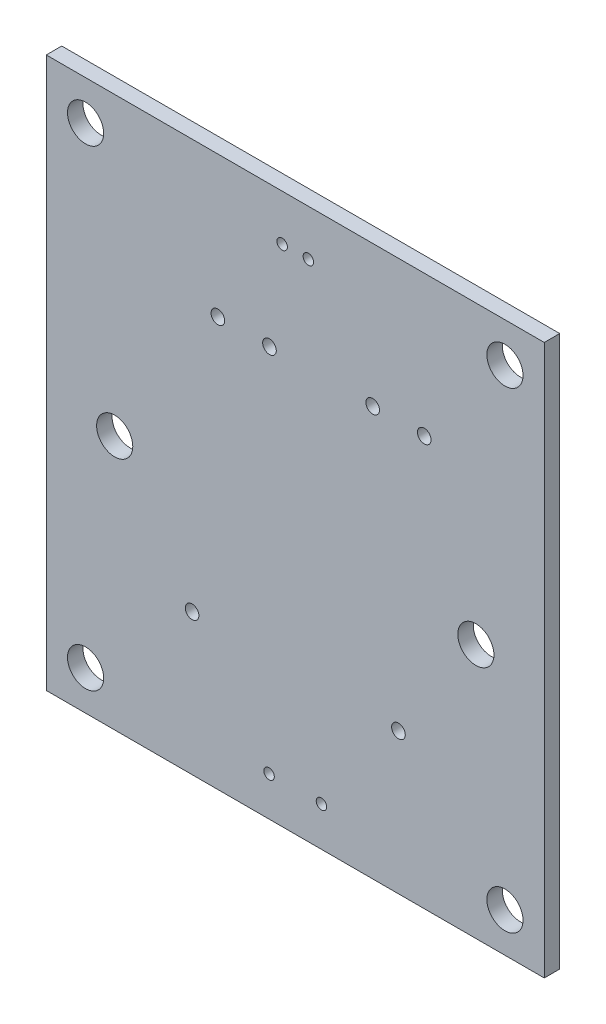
ISO-10303-21;
HEADER;
FILE_DESCRIPTION(('STEP AP214'),'2;1');
FILE_NAME('part.step','',(''),(''),'','','');
FILE_SCHEMA(('AUTOMOTIVE_DESIGN { 1 0 10303 214 1 1 1 1 }'));
ENDSEC;
DATA;
#1=APPLICATION_CONTEXT('core data for automotive mechanical design processes');
#2=APPLICATION_PROTOCOL_DEFINITION('international standard','automotive_design',2000,#1);
#3=PRODUCT_CONTEXT('',#1,'mechanical');
#4=PRODUCT('Part','Part','',(#3));
#5=PRODUCT_RELATED_PRODUCT_CATEGORY('part','',(#4));
#6=PRODUCT_DEFINITION_FORMATION('','',#4);
#7=PRODUCT_DEFINITION_CONTEXT('part definition',#1,'design');
#8=PRODUCT_DEFINITION('design','',#6,#7);
#9=PRODUCT_DEFINITION_SHAPE('','',#8);
#10=(LENGTH_UNIT() NAMED_UNIT(*) SI_UNIT(.MILLI.,.METRE.));
#11=(NAMED_UNIT(*) PLANE_ANGLE_UNIT() SI_UNIT($,.RADIAN.));
#12=(NAMED_UNIT(*) SI_UNIT($,.STERADIAN.) SOLID_ANGLE_UNIT());
#13=UNCERTAINTY_MEASURE_WITH_UNIT(LENGTH_MEASURE(1.E-05),#10,'distance_accuracy_value','');
#14=(GEOMETRIC_REPRESENTATION_CONTEXT(3) GLOBAL_UNCERTAINTY_ASSIGNED_CONTEXT((#13)) GLOBAL_UNIT_ASSIGNED_CONTEXT((#10,
#11,#12)) REPRESENTATION_CONTEXT('',''));
#15=CARTESIAN_POINT('',(0.,0.,0.));
#16=DIRECTION('',(0.,0.,1.));
#17=DIRECTION('',(1.,0.,0.));
#18=AXIS2_PLACEMENT_3D('',#15,#16,#17);
#19=CARTESIAN_POINT('',(0.,0.,1.4986));
#20=DIRECTION('',(1.,0.,0.));
#21=DIRECTION('',(0.,0.,-1.));
#22=AXIS2_PLACEMENT_3D('',#19,#20,#21);
#23=PLANE('',#22);
#24=DIRECTION('',(0.,-1.,0.));
#25=VECTOR('',#24,1.);
#26=CARTESIAN_POINT('',(0.,0.,0.));
#27=LINE('',#26,#25);
#28=CARTESIAN_POINT('',(0.,0.,0.));
#29=VERTEX_POINT('',#28);
#30=CARTESIAN_POINT('',(0.,-53.34,0.));
#31=VERTEX_POINT('',#30);
#32=EDGE_CURVE('E94',#29,#31,#27,.T.);
#33=ORIENTED_EDGE('',*,*,#32,.T.);
#34=DIRECTION('',(0.,0.,-1.));
#35=VECTOR('',#34,1.);
#36=CARTESIAN_POINT('',(0.,-53.34,1.4986));
#37=LINE('',#36,#35);
#38=CARTESIAN_POINT('',(0.,-53.34,1.4986));
#39=VERTEX_POINT('',#38);
#40=EDGE_CURVE('E11',#39,#31,#37,.T.);
#41=ORIENTED_EDGE('',*,*,#40,.F.);
#42=DIRECTION('',(0.,-1.,0.));
#43=VECTOR('',#42,1.);
#44=CARTESIAN_POINT('',(0.,0.,1.4986));
#45=LINE('',#44,#43);
#46=CARTESIAN_POINT('',(0.,0.,1.4986));
#47=VERTEX_POINT('',#46);
#48=EDGE_CURVE('E82',#47,#39,#45,.T.);
#49=ORIENTED_EDGE('',*,*,#48,.F.);
#50=DIRECTION('',(0.,0.,-1.));
#51=VECTOR('',#50,1.);
#52=CARTESIAN_POINT('',(0.,0.,1.4986));
#53=LINE('',#52,#51);
#54=EDGE_CURVE('E90',#47,#29,#53,.T.);
#55=ORIENTED_EDGE('',*,*,#54,.T.);
#56=EDGE_LOOP('',(#33,#41,#49,#55));
#57=FACE_BOUND('',#56,.T.);
#58=ADVANCED_FACE('F31',(#57),#23,.F.);
#59=CARTESIAN_POINT('',(0.,-53.34,1.4986));
#60=DIRECTION('',(0.,1.,0.));
#61=DIRECTION('',(0.,0.,1.));
#62=AXIS2_PLACEMENT_3D('',#59,#60,#61);
#63=PLANE('',#62);
#64=DIRECTION('',(1.,0.,0.));
#65=VECTOR('',#64,1.);
#66=CARTESIAN_POINT('',(0.,-53.34,0.));
#67=LINE('',#66,#65);
#68=CARTESIAN_POINT('',(48.26,-53.34,0.));
#69=VERTEX_POINT('',#68);
#70=EDGE_CURVE('E86',#31,#69,#67,.T.);
#71=ORIENTED_EDGE('',*,*,#70,.T.);
#72=DIRECTION('',(0.,0.,-1.));
#73=VECTOR('',#72,1.);
#74=CARTESIAN_POINT('',(48.26,-53.34,1.4986));
#75=LINE('',#74,#73);
#76=CARTESIAN_POINT('',(48.26,-53.34,1.4986));
#77=VERTEX_POINT('',#76);
#78=EDGE_CURVE('E39',#77,#69,#75,.T.);
#79=ORIENTED_EDGE('',*,*,#78,.F.);
#80=DIRECTION('',(1.,0.,0.));
#81=VECTOR('',#80,1.);
#82=CARTESIAN_POINT('',(0.,-53.34,1.4986));
#83=LINE('',#82,#81);
#84=EDGE_CURVE('E77',#39,#77,#83,.T.);
#85=ORIENTED_EDGE('',*,*,#84,.F.);
#86=ORIENTED_EDGE('',*,*,#40,.T.);
#87=EDGE_LOOP('',(#71,#79,#85,#86));
#88=FACE_BOUND('',#87,.T.);
#89=ADVANCED_FACE('F85',(#88),#63,.F.);
#90=CARTESIAN_POINT('',(48.26,0.,1.4986));
#91=DIRECTION('',(-1.,0.,0.));
#92=DIRECTION('',(0.,-1.,0.));
#93=AXIS2_PLACEMENT_3D('',#90,#91,#92);
#94=PLANE('',#93);
#95=DIRECTION('',(0.,1.,0.));
#96=VECTOR('',#95,1.);
#97=CARTESIAN_POINT('',(48.26,0.,0.));
#98=LINE('',#97,#96);
#99=CARTESIAN_POINT('',(48.26,0.,0.));
#100=VERTEX_POINT('',#99);
#101=EDGE_CURVE('E64',#69,#100,#98,.T.);
#102=ORIENTED_EDGE('',*,*,#101,.T.);
#103=DIRECTION('',(0.,0.,-1.));
#104=VECTOR('',#103,1.);
#105=CARTESIAN_POINT('',(48.26,0.,1.4986));
#106=LINE('',#105,#104);
#107=CARTESIAN_POINT('',(48.26,0.,1.4986));
#108=VERTEX_POINT('',#107);
#109=EDGE_CURVE('E87',#108,#100,#106,.T.);
#110=ORIENTED_EDGE('',*,*,#109,.F.);
#111=DIRECTION('',(0.,1.,0.));
#112=VECTOR('',#111,1.);
#113=CARTESIAN_POINT('',(48.26,0.,1.4986));
#114=LINE('',#113,#112);
#115=EDGE_CURVE('E80',#77,#108,#114,.T.);
#116=ORIENTED_EDGE('',*,*,#115,.F.);
#117=ORIENTED_EDGE('',*,*,#78,.T.);
#118=EDGE_LOOP('',(#102,#110,#116,#117));
#119=FACE_BOUND('',#118,.T.);
#120=ADVANCED_FACE('F88',(#119),#94,.F.);
#121=CARTESIAN_POINT('',(0.,0.,1.4986));
#122=DIRECTION('',(0.,-1.,0.));
#123=DIRECTION('',(0.,0.,-1.));
#124=AXIS2_PLACEMENT_3D('',#121,#122,#123);
#125=PLANE('',#124);
#126=DIRECTION('',(-1.,0.,0.));
#127=VECTOR('',#126,1.);
#128=CARTESIAN_POINT('',(0.,0.,0.));
#129=LINE('',#128,#127);
#130=EDGE_CURVE('E70',#100,#29,#129,.T.);
#131=ORIENTED_EDGE('',*,*,#130,.T.);
#132=ORIENTED_EDGE('',*,*,#54,.F.);
#133=DIRECTION('',(-1.,0.,0.));
#134=VECTOR('',#133,1.);
#135=CARTESIAN_POINT('',(0.,0.,1.4986));
#136=LINE('',#135,#134);
#137=EDGE_CURVE('E47',#108,#47,#136,.T.);
#138=ORIENTED_EDGE('',*,*,#137,.F.);
#139=ORIENTED_EDGE('',*,*,#109,.T.);
#140=EDGE_LOOP('',(#131,#132,#138,#139));
#141=FACE_BOUND('',#140,.T.);
#142=ADVANCED_FACE('F102',(#141),#125,.F.);
#143=CARTESIAN_POINT('',(0.,-53.34,1.4986));
#144=DIRECTION('',(0.,0.,1.));
#145=DIRECTION('',(1.,0.,0.));
#146=AXIS2_PLACEMENT_3D('',#143,#144,#145);
#147=PLANE('',#146);
#148=CARTESIAN_POINT('',(41.6306,-28.66898,1.4986));
#149=DIRECTION('',(0.,0.,1.));
#150=DIRECTION('',(1.,0.,0.));
#151=AXIS2_PLACEMENT_3D('',#148,#149,#150);
#152=CIRCLE('',#151,1.7526);
#153=CARTESIAN_POINT('',(43.3832,-28.66898,1.4986));
#154=VERTEX_POINT('',#153);
#155=EDGE_CURVE('E200',#154,#154,#152,.T.);
#156=ORIENTED_EDGE('',*,*,#155,.F.);
#157=EDGE_LOOP('',(#156));
#158=FACE_BOUND('',#157,.T.);
#159=CARTESIAN_POINT('',(6.6294,-28.66898,1.4986));
#160=DIRECTION('',(0.,0.,1.));
#161=DIRECTION('',(1.,0.,0.));
#162=AXIS2_PLACEMENT_3D('',#159,#160,#161);
#163=CIRCLE('',#162,1.7526);
#164=CARTESIAN_POINT('',(8.382,-28.66898,1.4986));
#165=VERTEX_POINT('',#164);
#166=EDGE_CURVE('E194',#165,#165,#163,.T.);
#167=ORIENTED_EDGE('',*,*,#166,.F.);
#168=EDGE_LOOP('',(#167));
#169=FACE_BOUND('',#168,.T.);
#170=CARTESIAN_POINT('',(34.12998,-39.66972,1.4986));
#171=DIRECTION('',(0.,0.,1.));
#172=DIRECTION('',(1.,0.,0.));
#173=AXIS2_PLACEMENT_3D('',#170,#171,#172);
#174=CIRCLE('',#173,0.660399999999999);
#175=CARTESIAN_POINT('',(34.79038,-39.66972,1.4986));
#176=VERTEX_POINT('',#175);
#177=EDGE_CURVE('E188',#176,#176,#174,.T.);
#178=ORIENTED_EDGE('',*,*,#177,.F.);
#179=EDGE_LOOP('',(#178));
#180=FACE_BOUND('',#179,.T.);
#181=CARTESIAN_POINT('',(14.13002,-39.66972,1.4986));
#182=DIRECTION('',(0.,0.,1.));
#183=DIRECTION('',(1.,0.,0.));
#184=AXIS2_PLACEMENT_3D('',#181,#182,#183);
#185=CIRCLE('',#184,0.660400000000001);
#186=CARTESIAN_POINT('',(14.79042,-39.66972,1.4986));
#187=VERTEX_POINT('',#186);
#188=EDGE_CURVE('E182',#187,#187,#185,.T.);
#189=ORIENTED_EDGE('',*,*,#188,.F.);
#190=EDGE_LOOP('',(#189));
#191=FACE_BOUND('',#190,.T.);
#192=CARTESIAN_POINT('',(36.62934,-13.67028,1.4986));
#193=DIRECTION('',(0.,0.,1.));
#194=DIRECTION('',(1.,0.,0.));
#195=AXIS2_PLACEMENT_3D('',#192,#193,#194);
#196=CIRCLE('',#195,0.660399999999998);
#197=CARTESIAN_POINT('',(37.28974,-13.67028,1.4986));
#198=VERTEX_POINT('',#197);
#199=EDGE_CURVE('E176',#198,#198,#196,.T.);
#200=ORIENTED_EDGE('',*,*,#199,.F.);
#201=EDGE_LOOP('',(#200));
#202=FACE_BOUND('',#201,.T.);
#203=CARTESIAN_POINT('',(31.63062,-13.67028,1.4986));
#204=DIRECTION('',(0.,0.,1.));
#205=DIRECTION('',(1.,0.,0.));
#206=AXIS2_PLACEMENT_3D('',#203,#204,#205);
#207=CIRCLE('',#206,0.660399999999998);
#208=CARTESIAN_POINT('',(32.29102,-13.67028,1.4986));
#209=VERTEX_POINT('',#208);
#210=EDGE_CURVE('E170',#209,#209,#207,.T.);
#211=ORIENTED_EDGE('',*,*,#210,.F.);
#212=EDGE_LOOP('',(#211));
#213=FACE_BOUND('',#212,.T.);
#214=CARTESIAN_POINT('',(21.63064,-13.67028,1.4986));
#215=DIRECTION('',(0.,0.,1.));
#216=DIRECTION('',(1.,0.,0.));
#217=AXIS2_PLACEMENT_3D('',#214,#215,#216);
#218=CIRCLE('',#217,0.660399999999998);
#219=CARTESIAN_POINT('',(22.29104,-13.67028,1.4986));
#220=VERTEX_POINT('',#219);
#221=EDGE_CURVE('E164',#220,#220,#218,.T.);
#222=ORIENTED_EDGE('',*,*,#221,.F.);
#223=EDGE_LOOP('',(#222));
#224=FACE_BOUND('',#223,.T.);
#225=CARTESIAN_POINT('',(16.62938,-13.67028,1.4986));
#226=DIRECTION('',(0.,0.,1.));
#227=DIRECTION('',(1.,0.,0.));
#228=AXIS2_PLACEMENT_3D('',#225,#226,#227);
#229=CIRCLE('',#228,0.660399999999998);
#230=CARTESIAN_POINT('',(17.28978,-13.67028,1.4986));
#231=VERTEX_POINT('',#230);
#232=EDGE_CURVE('E158',#231,#231,#229,.T.);
#233=ORIENTED_EDGE('',*,*,#232,.F.);
#234=EDGE_LOOP('',(#233));
#235=FACE_BOUND('',#234,.T.);
#236=CARTESIAN_POINT('',(25.4,-4.445,1.4986));
#237=DIRECTION('',(0.,0.,1.));
#238=DIRECTION('',(1.,0.,0.));
#239=AXIS2_PLACEMENT_3D('',#236,#237,#238);
#240=CIRCLE('',#239,0.508000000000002);
#241=CARTESIAN_POINT('',(25.908,-4.445,1.4986));
#242=VERTEX_POINT('',#241);
#243=EDGE_CURVE('E152',#242,#242,#240,.T.);
#244=ORIENTED_EDGE('',*,*,#243,.F.);
#245=EDGE_LOOP('',(#244));
#246=FACE_BOUND('',#245,.T.);
#247=CARTESIAN_POINT('',(22.86,-4.445,1.4986));
#248=DIRECTION('',(0.,0.,1.));
#249=DIRECTION('',(1.,0.,0.));
#250=AXIS2_PLACEMENT_3D('',#247,#248,#249);
#251=CIRCLE('',#250,0.508000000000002);
#252=CARTESIAN_POINT('',(23.368,-4.445,1.4986));
#253=VERTEX_POINT('',#252);
#254=EDGE_CURVE('E146',#253,#253,#251,.T.);
#255=ORIENTED_EDGE('',*,*,#254,.F.);
#256=EDGE_LOOP('',(#255));
#257=FACE_BOUND('',#256,.T.);
#258=CARTESIAN_POINT('',(26.67,-49.53,1.4986));
#259=DIRECTION('',(0.,0.,1.));
#260=DIRECTION('',(1.,0.,0.));
#261=AXIS2_PLACEMENT_3D('',#258,#259,#260);
#262=CIRCLE('',#261,0.508000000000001);
#263=CARTESIAN_POINT('',(27.178,-49.53,1.4986));
#264=VERTEX_POINT('',#263);
#265=EDGE_CURVE('E140',#264,#264,#262,.T.);
#266=ORIENTED_EDGE('',*,*,#265,.F.);
#267=EDGE_LOOP('',(#266));
#268=FACE_BOUND('',#267,.T.);
#269=CARTESIAN_POINT('',(21.59,-49.53,1.4986));
#270=DIRECTION('',(0.,0.,1.));
#271=DIRECTION('',(1.,0.,0.));
#272=AXIS2_PLACEMENT_3D('',#269,#270,#271);
#273=CIRCLE('',#272,0.508000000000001);
#274=CARTESIAN_POINT('',(22.098,-49.53,1.4986));
#275=VERTEX_POINT('',#274);
#276=EDGE_CURVE('E134',#275,#275,#273,.T.);
#277=ORIENTED_EDGE('',*,*,#276,.F.);
#278=EDGE_LOOP('',(#277));
#279=FACE_BOUND('',#278,.T.);
#280=CARTESIAN_POINT('',(3.81,-49.53,1.4986));
#281=DIRECTION('',(0.,0.,1.));
#282=DIRECTION('',(1.,0.,0.));
#283=AXIS2_PLACEMENT_3D('',#280,#281,#282);
#284=CIRCLE('',#283,1.7526);
#285=CARTESIAN_POINT('',(5.5626,-49.53,1.4986));
#286=VERTEX_POINT('',#285);
#287=EDGE_CURVE('E128',#286,#286,#284,.T.);
#288=ORIENTED_EDGE('',*,*,#287,.F.);
#289=EDGE_LOOP('',(#288));
#290=FACE_BOUND('',#289,.T.);
#291=CARTESIAN_POINT('',(44.45,-49.53,1.4986));
#292=DIRECTION('',(0.,0.,1.));
#293=DIRECTION('',(1.,0.,0.));
#294=AXIS2_PLACEMENT_3D('',#291,#292,#293);
#295=CIRCLE('',#294,1.7526);
#296=CARTESIAN_POINT('',(46.2026,-49.53,1.4986));
#297=VERTEX_POINT('',#296);
#298=EDGE_CURVE('E122',#297,#297,#295,.T.);
#299=ORIENTED_EDGE('',*,*,#298,.F.);
#300=EDGE_LOOP('',(#299));
#301=FACE_BOUND('',#300,.T.);
#302=CARTESIAN_POINT('',(44.45,-3.81,1.4986));
#303=DIRECTION('',(0.,0.,1.));
#304=DIRECTION('',(1.,0.,0.));
#305=AXIS2_PLACEMENT_3D('',#302,#303,#304);
#306=CIRCLE('',#305,1.7526);
#307=CARTESIAN_POINT('',(46.2026,-3.81,1.4986));
#308=VERTEX_POINT('',#307);
#309=EDGE_CURVE('E116',#308,#308,#306,.T.);
#310=ORIENTED_EDGE('',*,*,#309,.F.);
#311=EDGE_LOOP('',(#310));
#312=FACE_BOUND('',#311,.T.);
#313=CARTESIAN_POINT('',(3.81,-3.81,1.4986));
#314=DIRECTION('',(0.,0.,1.));
#315=DIRECTION('',(1.,0.,0.));
#316=AXIS2_PLACEMENT_3D('',#313,#314,#315);
#317=CIRCLE('',#316,1.7526);
#318=CARTESIAN_POINT('',(5.5626,-3.81,1.4986));
#319=VERTEX_POINT('',#318);
#320=EDGE_CURVE('E110',#319,#319,#317,.T.);
#321=ORIENTED_EDGE('',*,*,#320,.F.);
#322=EDGE_LOOP('',(#321));
#323=FACE_BOUND('',#322,.T.);
#324=ORIENTED_EDGE('',*,*,#48,.T.);
#325=ORIENTED_EDGE('',*,*,#84,.T.);
#326=ORIENTED_EDGE('',*,*,#115,.T.);
#327=ORIENTED_EDGE('',*,*,#137,.T.);
#328=EDGE_LOOP('',(#324,#325,#326,#327));
#329=FACE_BOUND('',#328,.T.);
#330=ADVANCED_FACE('F78',(#158,#169,#180,#191,#202,#213,#224,#235,#246,#257,#268,#279,#290,#301,
#312,#323,#329),#147,.T.);
#331=CARTESIAN_POINT('',(0.,-53.34,0.));
#332=DIRECTION('',(0.,0.,1.));
#333=DIRECTION('',(1.,0.,0.));
#334=AXIS2_PLACEMENT_3D('',#331,#332,#333);
#335=PLANE('',#334);
#336=CARTESIAN_POINT('',(41.6306,-28.66898,0.));
#337=DIRECTION('',(0.,0.,1.));
#338=DIRECTION('',(1.,0.,0.));
#339=AXIS2_PLACEMENT_3D('',#336,#337,#338);
#340=CIRCLE('',#339,1.7526);
#341=CARTESIAN_POINT('',(43.3832,-28.66898,0.));
#342=VERTEX_POINT('',#341);
#343=EDGE_CURVE('E197',#342,#342,#340,.F.);
#344=ORIENTED_EDGE('',*,*,#343,.F.);
#345=EDGE_LOOP('',(#344));
#346=FACE_BOUND('',#345,.T.);
#347=CARTESIAN_POINT('',(6.6294,-28.66898,0.));
#348=DIRECTION('',(0.,0.,1.));
#349=DIRECTION('',(1.,0.,0.));
#350=AXIS2_PLACEMENT_3D('',#347,#348,#349);
#351=CIRCLE('',#350,1.7526);
#352=CARTESIAN_POINT('',(8.382,-28.66898,0.));
#353=VERTEX_POINT('',#352);
#354=EDGE_CURVE('E191',#353,#353,#351,.F.);
#355=ORIENTED_EDGE('',*,*,#354,.F.);
#356=EDGE_LOOP('',(#355));
#357=FACE_BOUND('',#356,.T.);
#358=CARTESIAN_POINT('',(34.12998,-39.66972,0.));
#359=DIRECTION('',(0.,0.,1.));
#360=DIRECTION('',(1.,0.,0.));
#361=AXIS2_PLACEMENT_3D('',#358,#359,#360);
#362=CIRCLE('',#361,0.660399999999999);
#363=CARTESIAN_POINT('',(34.79038,-39.66972,0.));
#364=VERTEX_POINT('',#363);
#365=EDGE_CURVE('E185',#364,#364,#362,.F.);
#366=ORIENTED_EDGE('',*,*,#365,.F.);
#367=EDGE_LOOP('',(#366));
#368=FACE_BOUND('',#367,.T.);
#369=CARTESIAN_POINT('',(14.13002,-39.66972,0.));
#370=DIRECTION('',(0.,0.,1.));
#371=DIRECTION('',(1.,0.,0.));
#372=AXIS2_PLACEMENT_3D('',#369,#370,#371);
#373=CIRCLE('',#372,0.660400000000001);
#374=CARTESIAN_POINT('',(14.79042,-39.66972,0.));
#375=VERTEX_POINT('',#374);
#376=EDGE_CURVE('E179',#375,#375,#373,.F.);
#377=ORIENTED_EDGE('',*,*,#376,.F.);
#378=EDGE_LOOP('',(#377));
#379=FACE_BOUND('',#378,.T.);
#380=CARTESIAN_POINT('',(36.62934,-13.67028,0.));
#381=DIRECTION('',(0.,0.,1.));
#382=DIRECTION('',(1.,0.,0.));
#383=AXIS2_PLACEMENT_3D('',#380,#381,#382);
#384=CIRCLE('',#383,0.660399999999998);
#385=CARTESIAN_POINT('',(37.28974,-13.67028,0.));
#386=VERTEX_POINT('',#385);
#387=EDGE_CURVE('E173',#386,#386,#384,.F.);
#388=ORIENTED_EDGE('',*,*,#387,.F.);
#389=EDGE_LOOP('',(#388));
#390=FACE_BOUND('',#389,.T.);
#391=CARTESIAN_POINT('',(31.63062,-13.67028,0.));
#392=DIRECTION('',(0.,0.,1.));
#393=DIRECTION('',(1.,0.,0.));
#394=AXIS2_PLACEMENT_3D('',#391,#392,#393);
#395=CIRCLE('',#394,0.660399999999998);
#396=CARTESIAN_POINT('',(32.29102,-13.67028,0.));
#397=VERTEX_POINT('',#396);
#398=EDGE_CURVE('E167',#397,#397,#395,.F.);
#399=ORIENTED_EDGE('',*,*,#398,.F.);
#400=EDGE_LOOP('',(#399));
#401=FACE_BOUND('',#400,.T.);
#402=CARTESIAN_POINT('',(21.63064,-13.67028,0.));
#403=DIRECTION('',(0.,0.,1.));
#404=DIRECTION('',(1.,0.,0.));
#405=AXIS2_PLACEMENT_3D('',#402,#403,#404);
#406=CIRCLE('',#405,0.660399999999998);
#407=CARTESIAN_POINT('',(22.29104,-13.67028,0.));
#408=VERTEX_POINT('',#407);
#409=EDGE_CURVE('E161',#408,#408,#406,.F.);
#410=ORIENTED_EDGE('',*,*,#409,.F.);
#411=EDGE_LOOP('',(#410));
#412=FACE_BOUND('',#411,.T.);
#413=CARTESIAN_POINT('',(16.62938,-13.67028,0.));
#414=DIRECTION('',(0.,0.,1.));
#415=DIRECTION('',(1.,0.,0.));
#416=AXIS2_PLACEMENT_3D('',#413,#414,#415);
#417=CIRCLE('',#416,0.660399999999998);
#418=CARTESIAN_POINT('',(17.28978,-13.67028,0.));
#419=VERTEX_POINT('',#418);
#420=EDGE_CURVE('E155',#419,#419,#417,.F.);
#421=ORIENTED_EDGE('',*,*,#420,.F.);
#422=EDGE_LOOP('',(#421));
#423=FACE_BOUND('',#422,.T.);
#424=CARTESIAN_POINT('',(25.4,-4.445,0.));
#425=DIRECTION('',(0.,0.,1.));
#426=DIRECTION('',(1.,0.,0.));
#427=AXIS2_PLACEMENT_3D('',#424,#425,#426);
#428=CIRCLE('',#427,0.508000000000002);
#429=CARTESIAN_POINT('',(25.908,-4.445,0.));
#430=VERTEX_POINT('',#429);
#431=EDGE_CURVE('E149',#430,#430,#428,.F.);
#432=ORIENTED_EDGE('',*,*,#431,.F.);
#433=EDGE_LOOP('',(#432));
#434=FACE_BOUND('',#433,.T.);
#435=CARTESIAN_POINT('',(22.86,-4.445,0.));
#436=DIRECTION('',(0.,0.,1.));
#437=DIRECTION('',(1.,0.,0.));
#438=AXIS2_PLACEMENT_3D('',#435,#436,#437);
#439=CIRCLE('',#438,0.508000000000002);
#440=CARTESIAN_POINT('',(23.368,-4.445,0.));
#441=VERTEX_POINT('',#440);
#442=EDGE_CURVE('E143',#441,#441,#439,.F.);
#443=ORIENTED_EDGE('',*,*,#442,.F.);
#444=EDGE_LOOP('',(#443));
#445=FACE_BOUND('',#444,.T.);
#446=CARTESIAN_POINT('',(26.67,-49.53,0.));
#447=DIRECTION('',(0.,0.,1.));
#448=DIRECTION('',(1.,0.,0.));
#449=AXIS2_PLACEMENT_3D('',#446,#447,#448);
#450=CIRCLE('',#449,0.508000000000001);
#451=CARTESIAN_POINT('',(27.178,-49.53,0.));
#452=VERTEX_POINT('',#451);
#453=EDGE_CURVE('E137',#452,#452,#450,.F.);
#454=ORIENTED_EDGE('',*,*,#453,.F.);
#455=EDGE_LOOP('',(#454));
#456=FACE_BOUND('',#455,.T.);
#457=CARTESIAN_POINT('',(21.59,-49.53,0.));
#458=DIRECTION('',(0.,0.,1.));
#459=DIRECTION('',(1.,0.,0.));
#460=AXIS2_PLACEMENT_3D('',#457,#458,#459);
#461=CIRCLE('',#460,0.508000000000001);
#462=CARTESIAN_POINT('',(22.098,-49.53,0.));
#463=VERTEX_POINT('',#462);
#464=EDGE_CURVE('E131',#463,#463,#461,.F.);
#465=ORIENTED_EDGE('',*,*,#464,.F.);
#466=EDGE_LOOP('',(#465));
#467=FACE_BOUND('',#466,.T.);
#468=CARTESIAN_POINT('',(3.81,-49.53,0.));
#469=DIRECTION('',(0.,0.,1.));
#470=DIRECTION('',(1.,0.,0.));
#471=AXIS2_PLACEMENT_3D('',#468,#469,#470);
#472=CIRCLE('',#471,1.7526);
#473=CARTESIAN_POINT('',(5.5626,-49.53,0.));
#474=VERTEX_POINT('',#473);
#475=EDGE_CURVE('E125',#474,#474,#472,.F.);
#476=ORIENTED_EDGE('',*,*,#475,.F.);
#477=EDGE_LOOP('',(#476));
#478=FACE_BOUND('',#477,.T.);
#479=CARTESIAN_POINT('',(44.45,-49.53,0.));
#480=DIRECTION('',(0.,0.,1.));
#481=DIRECTION('',(1.,0.,0.));
#482=AXIS2_PLACEMENT_3D('',#479,#480,#481);
#483=CIRCLE('',#482,1.7526);
#484=CARTESIAN_POINT('',(46.2026,-49.53,0.));
#485=VERTEX_POINT('',#484);
#486=EDGE_CURVE('E119',#485,#485,#483,.F.);
#487=ORIENTED_EDGE('',*,*,#486,.F.);
#488=EDGE_LOOP('',(#487));
#489=FACE_BOUND('',#488,.T.);
#490=CARTESIAN_POINT('',(44.45,-3.81,0.));
#491=DIRECTION('',(0.,0.,1.));
#492=DIRECTION('',(1.,0.,0.));
#493=AXIS2_PLACEMENT_3D('',#490,#491,#492);
#494=CIRCLE('',#493,1.7526);
#495=CARTESIAN_POINT('',(46.2026,-3.81,0.));
#496=VERTEX_POINT('',#495);
#497=EDGE_CURVE('E113',#496,#496,#494,.F.);
#498=ORIENTED_EDGE('',*,*,#497,.F.);
#499=EDGE_LOOP('',(#498));
#500=FACE_BOUND('',#499,.T.);
#501=CARTESIAN_POINT('',(3.81,-3.81,0.));
#502=DIRECTION('',(0.,0.,1.));
#503=DIRECTION('',(1.,0.,0.));
#504=AXIS2_PLACEMENT_3D('',#501,#502,#503);
#505=CIRCLE('',#504,1.7526);
#506=CARTESIAN_POINT('',(5.5626,-3.81,0.));
#507=VERTEX_POINT('',#506);
#508=EDGE_CURVE('E97',#507,#507,#505,.F.);
#509=ORIENTED_EDGE('',*,*,#508,.F.);
#510=EDGE_LOOP('',(#509));
#511=FACE_BOUND('',#510,.T.);
#512=ORIENTED_EDGE('',*,*,#32,.F.);
#513=ORIENTED_EDGE('',*,*,#130,.F.);
#514=ORIENTED_EDGE('',*,*,#101,.F.);
#515=ORIENTED_EDGE('',*,*,#70,.F.);
#516=EDGE_LOOP('',(#512,#513,#514,#515));
#517=FACE_BOUND('',#516,.T.);
#518=ADVANCED_FACE('F105',(#346,#357,#368,#379,#390,#401,#412,#423,#434,#445,#456,#467,#478,
#489,#500,#511,#517),#335,.F.);
#519=CARTESIAN_POINT('',(3.81,-3.81,-4.95710137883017));
#520=DIRECTION('',(0.,0.,1.));
#521=DIRECTION('',(1.,0.,0.));
#522=AXIS2_PLACEMENT_3D('',#519,#520,#521);
#523=CYLINDRICAL_SURFACE('',#522,1.7526);
#524=ORIENTED_EDGE('',*,*,#508,.T.);
#525=EDGE_LOOP('',(#524));
#526=FACE_BOUND('',#525,.T.);
#527=ORIENTED_EDGE('',*,*,#320,.T.);
#528=EDGE_LOOP('',(#527));
#529=FACE_BOUND('',#528,.T.);
#530=ADVANCED_FACE('F239',(#526,#529),#523,.F.);
#531=CARTESIAN_POINT('',(44.45,-3.81,-4.95710137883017));
#532=DIRECTION('',(0.,0.,1.));
#533=DIRECTION('',(1.,0.,0.));
#534=AXIS2_PLACEMENT_3D('',#531,#532,#533);
#535=CYLINDRICAL_SURFACE('',#534,1.7526);
#536=ORIENTED_EDGE('',*,*,#497,.T.);
#537=EDGE_LOOP('',(#536));
#538=FACE_BOUND('',#537,.T.);
#539=ORIENTED_EDGE('',*,*,#309,.T.);
#540=EDGE_LOOP('',(#539));
#541=FACE_BOUND('',#540,.T.);
#542=ADVANCED_FACE('F241',(#538,#541),#535,.F.);
#543=CARTESIAN_POINT('',(44.45,-49.53,-4.95710137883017));
#544=DIRECTION('',(0.,0.,1.));
#545=DIRECTION('',(1.,0.,0.));
#546=AXIS2_PLACEMENT_3D('',#543,#544,#545);
#547=CYLINDRICAL_SURFACE('',#546,1.7526);
#548=ORIENTED_EDGE('',*,*,#486,.T.);
#549=EDGE_LOOP('',(#548));
#550=FACE_BOUND('',#549,.T.);
#551=ORIENTED_EDGE('',*,*,#298,.T.);
#552=EDGE_LOOP('',(#551));
#553=FACE_BOUND('',#552,.T.);
#554=ADVANCED_FACE('F248',(#550,#553),#547,.F.);
#555=CARTESIAN_POINT('',(3.81,-49.53,-4.95710137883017));
#556=DIRECTION('',(0.,0.,1.));
#557=DIRECTION('',(1.,0.,0.));
#558=AXIS2_PLACEMENT_3D('',#555,#556,#557);
#559=CYLINDRICAL_SURFACE('',#558,1.7526);
#560=ORIENTED_EDGE('',*,*,#475,.T.);
#561=EDGE_LOOP('',(#560));
#562=FACE_BOUND('',#561,.T.);
#563=ORIENTED_EDGE('',*,*,#287,.T.);
#564=EDGE_LOOP('',(#563));
#565=FACE_BOUND('',#564,.T.);
#566=ADVANCED_FACE('F294',(#562,#565),#559,.F.);
#567=CARTESIAN_POINT('',(21.59,-49.53,-4.95710137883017));
#568=DIRECTION('',(0.,0.,1.));
#569=DIRECTION('',(1.,0.,0.));
#570=AXIS2_PLACEMENT_3D('',#567,#568,#569);
#571=CYLINDRICAL_SURFACE('',#570,0.508000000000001);
#572=ORIENTED_EDGE('',*,*,#464,.T.);
#573=EDGE_LOOP('',(#572));
#574=FACE_BOUND('',#573,.T.);
#575=ORIENTED_EDGE('',*,*,#276,.T.);
#576=EDGE_LOOP('',(#575));
#577=FACE_BOUND('',#576,.T.);
#578=ADVANCED_FACE('F304',(#574,#577),#571,.F.);
#579=CARTESIAN_POINT('',(26.67,-49.53,-4.95710137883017));
#580=DIRECTION('',(0.,0.,1.));
#581=DIRECTION('',(1.,0.,0.));
#582=AXIS2_PLACEMENT_3D('',#579,#580,#581);
#583=CYLINDRICAL_SURFACE('',#582,0.508000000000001);
#584=ORIENTED_EDGE('',*,*,#453,.T.);
#585=EDGE_LOOP('',(#584));
#586=FACE_BOUND('',#585,.T.);
#587=ORIENTED_EDGE('',*,*,#265,.T.);
#588=EDGE_LOOP('',(#587));
#589=FACE_BOUND('',#588,.T.);
#590=ADVANCED_FACE('F314',(#586,#589),#583,.F.);
#591=CARTESIAN_POINT('',(22.86,-4.445,-4.95710137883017));
#592=DIRECTION('',(0.,0.,1.));
#593=DIRECTION('',(1.,0.,0.));
#594=AXIS2_PLACEMENT_3D('',#591,#592,#593);
#595=CYLINDRICAL_SURFACE('',#594,0.508000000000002);
#596=ORIENTED_EDGE('',*,*,#442,.T.);
#597=EDGE_LOOP('',(#596));
#598=FACE_BOUND('',#597,.T.);
#599=ORIENTED_EDGE('',*,*,#254,.T.);
#600=EDGE_LOOP('',(#599));
#601=FACE_BOUND('',#600,.T.);
#602=ADVANCED_FACE('F324',(#598,#601),#595,.F.);
#603=CARTESIAN_POINT('',(25.4,-4.445,-4.95710137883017));
#604=DIRECTION('',(0.,0.,1.));
#605=DIRECTION('',(1.,0.,0.));
#606=AXIS2_PLACEMENT_3D('',#603,#604,#605);
#607=CYLINDRICAL_SURFACE('',#606,0.508000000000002);
#608=ORIENTED_EDGE('',*,*,#431,.T.);
#609=EDGE_LOOP('',(#608));
#610=FACE_BOUND('',#609,.T.);
#611=ORIENTED_EDGE('',*,*,#243,.T.);
#612=EDGE_LOOP('',(#611));
#613=FACE_BOUND('',#612,.T.);
#614=ADVANCED_FACE('F334',(#610,#613),#607,.F.);
#615=CARTESIAN_POINT('',(16.62938,-13.67028,-4.95710137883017));
#616=DIRECTION('',(0.,0.,1.));
#617=DIRECTION('',(1.,0.,0.));
#618=AXIS2_PLACEMENT_3D('',#615,#616,#617);
#619=CYLINDRICAL_SURFACE('',#618,0.660399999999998);
#620=ORIENTED_EDGE('',*,*,#420,.T.);
#621=EDGE_LOOP('',(#620));
#622=FACE_BOUND('',#621,.T.);
#623=ORIENTED_EDGE('',*,*,#232,.T.);
#624=EDGE_LOOP('',(#623));
#625=FACE_BOUND('',#624,.T.);
#626=ADVANCED_FACE('F344',(#622,#625),#619,.F.);
#627=CARTESIAN_POINT('',(21.63064,-13.67028,-4.95710137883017));
#628=DIRECTION('',(0.,0.,1.));
#629=DIRECTION('',(1.,0.,0.));
#630=AXIS2_PLACEMENT_3D('',#627,#628,#629);
#631=CYLINDRICAL_SURFACE('',#630,0.660399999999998);
#632=ORIENTED_EDGE('',*,*,#409,.T.);
#633=EDGE_LOOP('',(#632));
#634=FACE_BOUND('',#633,.T.);
#635=ORIENTED_EDGE('',*,*,#221,.T.);
#636=EDGE_LOOP('',(#635));
#637=FACE_BOUND('',#636,.T.);
#638=ADVANCED_FACE('F354',(#634,#637),#631,.F.);
#639=CARTESIAN_POINT('',(31.63062,-13.67028,-4.95710137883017));
#640=DIRECTION('',(0.,0.,1.));
#641=DIRECTION('',(1.,0.,0.));
#642=AXIS2_PLACEMENT_3D('',#639,#640,#641);
#643=CYLINDRICAL_SURFACE('',#642,0.660399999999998);
#644=ORIENTED_EDGE('',*,*,#398,.T.);
#645=EDGE_LOOP('',(#644));
#646=FACE_BOUND('',#645,.T.);
#647=ORIENTED_EDGE('',*,*,#210,.T.);
#648=EDGE_LOOP('',(#647));
#649=FACE_BOUND('',#648,.T.);
#650=ADVANCED_FACE('F364',(#646,#649),#643,.F.);
#651=CARTESIAN_POINT('',(36.62934,-13.67028,-4.95710137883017));
#652=DIRECTION('',(0.,0.,1.));
#653=DIRECTION('',(1.,0.,0.));
#654=AXIS2_PLACEMENT_3D('',#651,#652,#653);
#655=CYLINDRICAL_SURFACE('',#654,0.660399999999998);
#656=ORIENTED_EDGE('',*,*,#387,.T.);
#657=EDGE_LOOP('',(#656));
#658=FACE_BOUND('',#657,.T.);
#659=ORIENTED_EDGE('',*,*,#199,.T.);
#660=EDGE_LOOP('',(#659));
#661=FACE_BOUND('',#660,.T.);
#662=ADVANCED_FACE('F374',(#658,#661),#655,.F.);
#663=CARTESIAN_POINT('',(14.13002,-39.66972,-4.95710137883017));
#664=DIRECTION('',(0.,0.,1.));
#665=DIRECTION('',(1.,0.,0.));
#666=AXIS2_PLACEMENT_3D('',#663,#664,#665);
#667=CYLINDRICAL_SURFACE('',#666,0.660400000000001);
#668=ORIENTED_EDGE('',*,*,#376,.T.);
#669=EDGE_LOOP('',(#668));
#670=FACE_BOUND('',#669,.T.);
#671=ORIENTED_EDGE('',*,*,#188,.T.);
#672=EDGE_LOOP('',(#671));
#673=FACE_BOUND('',#672,.T.);
#674=ADVANCED_FACE('F384',(#670,#673),#667,.F.);
#675=CARTESIAN_POINT('',(34.12998,-39.66972,-4.95710137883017));
#676=DIRECTION('',(0.,0.,1.));
#677=DIRECTION('',(1.,0.,0.));
#678=AXIS2_PLACEMENT_3D('',#675,#676,#677);
#679=CYLINDRICAL_SURFACE('',#678,0.660399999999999);
#680=ORIENTED_EDGE('',*,*,#365,.T.);
#681=EDGE_LOOP('',(#680));
#682=FACE_BOUND('',#681,.T.);
#683=ORIENTED_EDGE('',*,*,#177,.T.);
#684=EDGE_LOOP('',(#683));
#685=FACE_BOUND('',#684,.T.);
#686=ADVANCED_FACE('F394',(#682,#685),#679,.F.);
#687=CARTESIAN_POINT('',(6.6294,-28.66898,-4.95710137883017));
#688=DIRECTION('',(0.,0.,1.));
#689=DIRECTION('',(1.,0.,0.));
#690=AXIS2_PLACEMENT_3D('',#687,#688,#689);
#691=CYLINDRICAL_SURFACE('',#690,1.7526);
#692=ORIENTED_EDGE('',*,*,#354,.T.);
#693=EDGE_LOOP('',(#692));
#694=FACE_BOUND('',#693,.T.);
#695=ORIENTED_EDGE('',*,*,#166,.T.);
#696=EDGE_LOOP('',(#695));
#697=FACE_BOUND('',#696,.T.);
#698=ADVANCED_FACE('F404',(#694,#697),#691,.F.);
#699=CARTESIAN_POINT('',(41.6306,-28.66898,-4.95710137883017));
#700=DIRECTION('',(0.,0.,1.));
#701=DIRECTION('',(1.,0.,0.));
#702=AXIS2_PLACEMENT_3D('',#699,#700,#701);
#703=CYLINDRICAL_SURFACE('',#702,1.7526);
#704=ORIENTED_EDGE('',*,*,#343,.T.);
#705=EDGE_LOOP('',(#704));
#706=FACE_BOUND('',#705,.T.);
#707=ORIENTED_EDGE('',*,*,#155,.T.);
#708=EDGE_LOOP('',(#707));
#709=FACE_BOUND('',#708,.T.);
#710=ADVANCED_FACE('F204',(#706,#709),#703,.F.);
#711=CLOSED_SHELL('',(#58,#89,#120,#142,#330,#518,#530,#542,#554,#566,#578,#590,#602,#614,#626,
#638,#650,#662,#674,#686,#698,#710));
#712=MANIFOLD_SOLID_BREP('B2',#711);
#713=ADVANCED_BREP_SHAPE_REPRESENTATION('',(#18,#712),#14);
#714=SHAPE_DEFINITION_REPRESENTATION(#9,#713);
ENDSEC;
END-ISO-10303-21;
